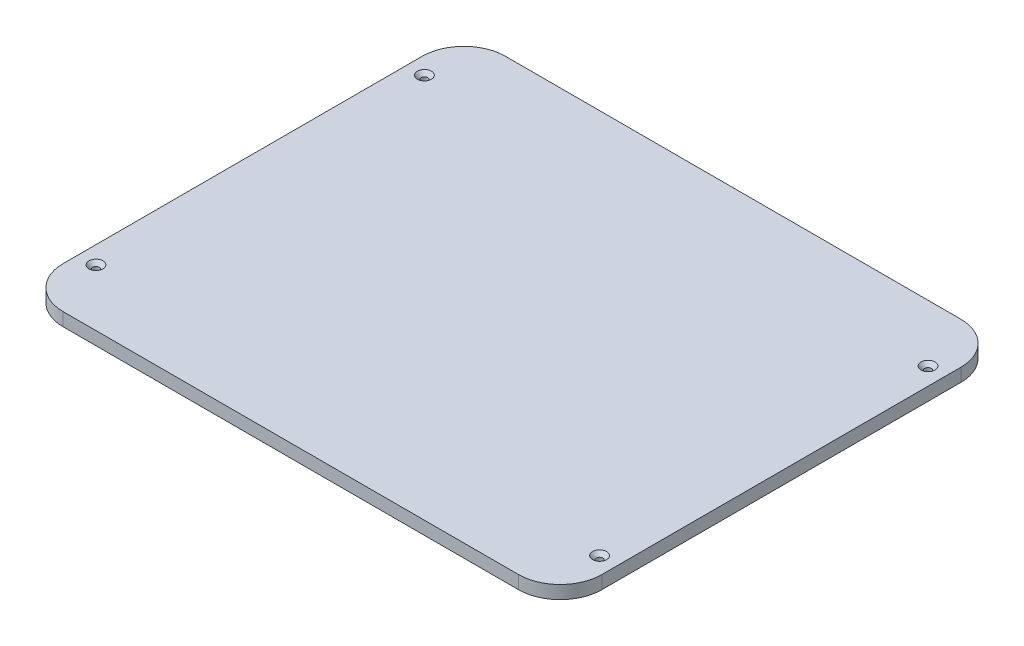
ISO-10303-21;
HEADER;
FILE_DESCRIPTION(('STEP AP214'),'2;1');
FILE_NAME('part.step','',(''),(''),'','','');
FILE_SCHEMA(('AUTOMOTIVE_DESIGN { 1 0 10303 214 1 1 1 1 }'));
ENDSEC;
DATA;
#1=APPLICATION_CONTEXT('core data for automotive mechanical design processes');
#2=APPLICATION_PROTOCOL_DEFINITION('international standard','automotive_design',2000,#1);
#3=PRODUCT_CONTEXT('',#1,'mechanical');
#4=PRODUCT('Part','Part','',(#3));
#5=PRODUCT_RELATED_PRODUCT_CATEGORY('part','',(#4));
#6=PRODUCT_DEFINITION_FORMATION('','',#4);
#7=PRODUCT_DEFINITION_CONTEXT('part definition',#1,'design');
#8=PRODUCT_DEFINITION('design','',#6,#7);
#9=PRODUCT_DEFINITION_SHAPE('','',#8);
#10=(LENGTH_UNIT() NAMED_UNIT(*) SI_UNIT(.MILLI.,.METRE.));
#11=(NAMED_UNIT(*) PLANE_ANGLE_UNIT() SI_UNIT($,.RADIAN.));
#12=(NAMED_UNIT(*) SI_UNIT($,.STERADIAN.) SOLID_ANGLE_UNIT());
#13=UNCERTAINTY_MEASURE_WITH_UNIT(LENGTH_MEASURE(1.E-05),#10,'distance_accuracy_value','');
#14=(GEOMETRIC_REPRESENTATION_CONTEXT(3) GLOBAL_UNCERTAINTY_ASSIGNED_CONTEXT((#13)) GLOBAL_UNIT_ASSIGNED_CONTEXT((#10,
#11,#12)) REPRESENTATION_CONTEXT('',''));
#15=CARTESIAN_POINT('',(0.,0.,0.));
#16=DIRECTION('',(0.,0.,1.));
#17=DIRECTION('',(1.,0.,0.));
#18=AXIS2_PLACEMENT_3D('',#15,#16,#17);
#19=CARTESIAN_POINT('',(123.,6.,101.));
#20=DIRECTION('',(-1.,0.,0.));
#21=DIRECTION('',(0.,0.,1.));
#22=AXIS2_PLACEMENT_3D('',#19,#20,#21);
#23=PLANE('',#22);
#24=DIRECTION('',(0.,0.,-1.));
#25=VECTOR('',#24,1.);
#26=CARTESIAN_POINT('',(123.,0.,101.));
#27=LINE('',#26,#25);
#28=CARTESIAN_POINT('',(123.,0.,82.));
#29=VERTEX_POINT('',#28);
#30=CARTESIAN_POINT('',(123.,0.,-82.));
#31=VERTEX_POINT('',#30);
#32=EDGE_CURVE('E143',#29,#31,#27,.T.);
#33=ORIENTED_EDGE('',*,*,#32,.T.);
#34=DIRECTION('',(0.,-1.,0.));
#35=VECTOR('',#34,1.);
#36=CARTESIAN_POINT('',(123.,6.,-82.));
#37=LINE('',#36,#35);
#38=CARTESIAN_POINT('',(123.,6.,-82.));
#39=VERTEX_POINT('',#38);
#40=EDGE_CURVE('E176',#31,#39,#37,.F.);
#41=ORIENTED_EDGE('',*,*,#40,.T.);
#42=DIRECTION('',(0.,0.,-1.));
#43=VECTOR('',#42,1.);
#44=CARTESIAN_POINT('',(123.,6.,101.));
#45=LINE('',#44,#43);
#46=CARTESIAN_POINT('',(123.,6.,82.));
#47=VERTEX_POINT('',#46);
#48=EDGE_CURVE('E140',#47,#39,#45,.T.);
#49=ORIENTED_EDGE('',*,*,#48,.F.);
#50=DIRECTION('',(0.,-1.,0.));
#51=VECTOR('',#50,1.);
#52=CARTESIAN_POINT('',(123.,6.,82.));
#53=LINE('',#52,#51);
#54=EDGE_CURVE('E172',#47,#29,#53,.T.);
#55=ORIENTED_EDGE('',*,*,#54,.T.);
#56=EDGE_LOOP('',(#33,#41,#49,#55));
#57=FACE_BOUND('',#56,.T.);
#58=ADVANCED_FACE('F38',(#57),#23,.F.);
#59=CARTESIAN_POINT('',(-123.,6.,-101.));
#60=DIRECTION('',(0.,0.,1.));
#61=DIRECTION('',(1.,0.,0.));
#62=AXIS2_PLACEMENT_3D('',#59,#60,#61);
#63=PLANE('',#62);
#64=DIRECTION('',(-1.,0.,0.));
#65=VECTOR('',#64,1.);
#66=CARTESIAN_POINT('',(-123.,0.,-101.));
#67=LINE('',#66,#65);
#68=CARTESIAN_POINT('',(104.,0.,-101.));
#69=VERTEX_POINT('',#68);
#70=CARTESIAN_POINT('',(-104.,0.,-101.));
#71=VERTEX_POINT('',#70);
#72=EDGE_CURVE('E135',#69,#71,#67,.T.);
#73=ORIENTED_EDGE('',*,*,#72,.T.);
#74=DIRECTION('',(0.,-1.,0.));
#75=VECTOR('',#74,1.);
#76=CARTESIAN_POINT('',(-104.,6.,-101.));
#77=LINE('',#76,#75);
#78=CARTESIAN_POINT('',(-104.,6.,-101.));
#79=VERTEX_POINT('',#78);
#80=EDGE_CURVE('E111',#71,#79,#77,.F.);
#81=ORIENTED_EDGE('',*,*,#80,.T.);
#82=DIRECTION('',(-1.,0.,0.));
#83=VECTOR('',#82,1.);
#84=CARTESIAN_POINT('',(-123.,6.,-101.));
#85=LINE('',#84,#83);
#86=CARTESIAN_POINT('',(104.,6.,-101.));
#87=VERTEX_POINT('',#86);
#88=EDGE_CURVE('E292',#87,#79,#85,.T.);
#89=ORIENTED_EDGE('',*,*,#88,.F.);
#90=DIRECTION('',(0.,-1.,0.));
#91=VECTOR('',#90,1.);
#92=CARTESIAN_POINT('',(104.,6.,-101.));
#93=LINE('',#92,#91);
#94=EDGE_CURVE('E117',#87,#69,#93,.T.);
#95=ORIENTED_EDGE('',*,*,#94,.T.);
#96=EDGE_LOOP('',(#73,#81,#89,#95));
#97=FACE_BOUND('',#96,.T.);
#98=ADVANCED_FACE('F228',(#97),#63,.F.);
#99=CARTESIAN_POINT('',(-123.,6.,101.));
#100=DIRECTION('',(1.,0.,0.));
#101=DIRECTION('',(0.,0.,-1.));
#102=AXIS2_PLACEMENT_3D('',#99,#100,#101);
#103=PLANE('',#102);
#104=DIRECTION('',(0.,0.,1.));
#105=VECTOR('',#104,1.);
#106=CARTESIAN_POINT('',(-123.,6.,101.));
#107=LINE('',#106,#105);
#108=CARTESIAN_POINT('',(-123.,6.,-82.));
#109=VERTEX_POINT('',#108);
#110=CARTESIAN_POINT('',(-123.,6.,82.));
#111=VERTEX_POINT('',#110);
#112=EDGE_CURVE('E126',#109,#111,#107,.T.);
#113=ORIENTED_EDGE('',*,*,#112,.F.);
#114=DIRECTION('',(0.,-1.,0.));
#115=VECTOR('',#114,1.);
#116=CARTESIAN_POINT('',(-123.,6.,-82.));
#117=LINE('',#116,#115);
#118=CARTESIAN_POINT('',(-123.,0.,-82.));
#119=VERTEX_POINT('',#118);
#120=EDGE_CURVE('E110',#109,#119,#117,.T.);
#121=ORIENTED_EDGE('',*,*,#120,.T.);
#122=DIRECTION('',(0.,0.,1.));
#123=VECTOR('',#122,1.);
#124=CARTESIAN_POINT('',(-123.,0.,101.));
#125=LINE('',#124,#123);
#126=CARTESIAN_POINT('',(-123.,0.,82.));
#127=VERTEX_POINT('',#126);
#128=EDGE_CURVE('E124',#119,#127,#125,.T.);
#129=ORIENTED_EDGE('',*,*,#128,.T.);
#130=DIRECTION('',(0.,-1.,0.));
#131=VECTOR('',#130,1.);
#132=CARTESIAN_POINT('',(-123.,6.,82.));
#133=LINE('',#132,#131);
#134=EDGE_CURVE('E129',#127,#111,#133,.F.);
#135=ORIENTED_EDGE('',*,*,#134,.T.);
#136=EDGE_LOOP('',(#113,#121,#129,#135));
#137=FACE_BOUND('',#136,.T.);
#138=ADVANCED_FACE('F123',(#137),#103,.F.);
#139=CARTESIAN_POINT('',(-123.,6.,101.));
#140=DIRECTION('',(0.,0.,-1.));
#141=DIRECTION('',(-1.,0.,0.));
#142=AXIS2_PLACEMENT_3D('',#139,#140,#141);
#143=PLANE('',#142);
#144=DIRECTION('',(1.,0.,0.));
#145=VECTOR('',#144,1.);
#146=CARTESIAN_POINT('',(-123.,0.,101.));
#147=LINE('',#146,#145);
#148=CARTESIAN_POINT('',(-104.,0.,101.));
#149=VERTEX_POINT('',#148);
#150=CARTESIAN_POINT('',(104.,0.,101.));
#151=VERTEX_POINT('',#150);
#152=EDGE_CURVE('E134',#149,#151,#147,.T.);
#153=ORIENTED_EDGE('',*,*,#152,.T.);
#154=DIRECTION('',(0.,-1.,0.));
#155=VECTOR('',#154,1.);
#156=CARTESIAN_POINT('',(104.,6.,101.));
#157=LINE('',#156,#155);
#158=CARTESIAN_POINT('',(104.,6.,101.));
#159=VERTEX_POINT('',#158);
#160=EDGE_CURVE('E54',#151,#159,#157,.F.);
#161=ORIENTED_EDGE('',*,*,#160,.T.);
#162=DIRECTION('',(1.,0.,0.));
#163=VECTOR('',#162,1.);
#164=CARTESIAN_POINT('',(-123.,6.,101.));
#165=LINE('',#164,#163);
#166=CARTESIAN_POINT('',(-104.,6.,101.));
#167=VERTEX_POINT('',#166);
#168=EDGE_CURVE('E148',#167,#159,#165,.T.);
#169=ORIENTED_EDGE('',*,*,#168,.F.);
#170=DIRECTION('',(0.,-1.,0.));
#171=VECTOR('',#170,1.);
#172=CARTESIAN_POINT('',(-104.,6.,101.));
#173=LINE('',#172,#171);
#174=EDGE_CURVE('E179',#167,#149,#173,.T.);
#175=ORIENTED_EDGE('',*,*,#174,.T.);
#176=EDGE_LOOP('',(#153,#161,#169,#175));
#177=FACE_BOUND('',#176,.T.);
#178=ADVANCED_FACE('F308',(#177),#143,.F.);
#179=CARTESIAN_POINT('',(0.,6.,0.));
#180=DIRECTION('',(0.,-1.,0.));
#181=DIRECTION('',(0.,0.,-1.));
#182=AXIS2_PLACEMENT_3D('',#179,#180,#181);
#183=PLANE('',#182);
#184=CARTESIAN_POINT('',(-115.,6.,75.));
#185=DIRECTION('',(0.,-1.,0.));
#186=DIRECTION('',(0.,0.,-1.));
#187=AXIS2_PLACEMENT_3D('',#184,#185,#186);
#188=CIRCLE('',#187,3.19999999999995);
#189=CARTESIAN_POINT('',(-115.,6.,71.8));
#190=VERTEX_POINT('',#189);
#191=EDGE_CURVE('E201',#190,#190,#188,.T.);
#192=ORIENTED_EDGE('',*,*,#191,.T.);
#193=EDGE_LOOP('',(#192));
#194=FACE_BOUND('',#193,.T.);
#195=CARTESIAN_POINT('',(115.,6.,75.));
#196=DIRECTION('',(0.,-1.,0.));
#197=DIRECTION('',(0.,0.,-1.));
#198=AXIS2_PLACEMENT_3D('',#195,#196,#197);
#199=CIRCLE('',#198,3.19999999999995);
#200=CARTESIAN_POINT('',(115.,6.,71.8));
#201=VERTEX_POINT('',#200);
#202=EDGE_CURVE('E197',#201,#201,#199,.T.);
#203=ORIENTED_EDGE('',*,*,#202,.T.);
#204=EDGE_LOOP('',(#203));
#205=FACE_BOUND('',#204,.T.);
#206=CARTESIAN_POINT('',(115.,6.,-75.));
#207=DIRECTION('',(0.,-1.,0.));
#208=DIRECTION('',(0.,0.,-1.));
#209=AXIS2_PLACEMENT_3D('',#206,#207,#208);
#210=CIRCLE('',#209,3.19999999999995);
#211=CARTESIAN_POINT('',(115.,6.,-78.1999999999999));
#212=VERTEX_POINT('',#211);
#213=EDGE_CURVE('E193',#212,#212,#210,.T.);
#214=ORIENTED_EDGE('',*,*,#213,.T.);
#215=EDGE_LOOP('',(#214));
#216=FACE_BOUND('',#215,.T.);
#217=CARTESIAN_POINT('',(-115.,6.,-75.));
#218=DIRECTION('',(0.,-1.,0.));
#219=DIRECTION('',(0.,0.,-1.));
#220=AXIS2_PLACEMENT_3D('',#217,#218,#219);
#221=CIRCLE('',#220,3.19999999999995);
#222=CARTESIAN_POINT('',(-115.,6.,-78.1999999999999));
#223=VERTEX_POINT('',#222);
#224=EDGE_CURVE('E189',#223,#223,#221,.T.);
#225=ORIENTED_EDGE('',*,*,#224,.T.);
#226=EDGE_LOOP('',(#225));
#227=FACE_BOUND('',#226,.T.);
#228=ORIENTED_EDGE('',*,*,#88,.T.);
#229=CARTESIAN_POINT('',(-104.,6.,-82.));
#230=DIRECTION('',(0.,-1.,0.));
#231=DIRECTION('',(0.,0.,-1.));
#232=AXIS2_PLACEMENT_3D('',#229,#230,#231);
#233=CIRCLE('',#232,19.);
#234=EDGE_CURVE('E169',#79,#109,#233,.F.);
#235=ORIENTED_EDGE('',*,*,#234,.T.);
#236=ORIENTED_EDGE('',*,*,#112,.T.);
#237=CARTESIAN_POINT('',(-104.,6.,82.));
#238=DIRECTION('',(0.,-1.,0.));
#239=DIRECTION('',(0.,0.,-1.));
#240=AXIS2_PLACEMENT_3D('',#237,#238,#239);
#241=CIRCLE('',#240,19.);
#242=EDGE_CURVE('E61',#111,#167,#241,.F.);
#243=ORIENTED_EDGE('',*,*,#242,.T.);
#244=ORIENTED_EDGE('',*,*,#168,.T.);
#245=CARTESIAN_POINT('',(104.,6.,82.));
#246=DIRECTION('',(0.,-1.,0.));
#247=DIRECTION('',(0.,0.,-1.));
#248=AXIS2_PLACEMENT_3D('',#245,#246,#247);
#249=CIRCLE('',#248,19.);
#250=EDGE_CURVE('E163',#159,#47,#249,.F.);
#251=ORIENTED_EDGE('',*,*,#250,.T.);
#252=ORIENTED_EDGE('',*,*,#48,.T.);
#253=CARTESIAN_POINT('',(104.,6.,-82.));
#254=DIRECTION('',(0.,-1.,0.));
#255=DIRECTION('',(0.,0.,-1.));
#256=AXIS2_PLACEMENT_3D('',#253,#254,#255);
#257=CIRCLE('',#256,19.);
#258=EDGE_CURVE('E166',#39,#87,#257,.F.);
#259=ORIENTED_EDGE('',*,*,#258,.T.);
#260=EDGE_LOOP('',(#228,#235,#236,#243,#244,#251,#252,#259));
#261=FACE_BOUND('',#260,.T.);
#262=ADVANCED_FACE('F306',(#194,#205,#216,#227,#261),#183,.F.);
#263=CARTESIAN_POINT('',(0.,0.,0.));
#264=DIRECTION('',(0.,-1.,0.));
#265=DIRECTION('',(0.,0.,-1.));
#266=AXIS2_PLACEMENT_3D('',#263,#264,#265);
#267=PLANE('',#266);
#268=CARTESIAN_POINT('',(115.,0.,-75.));
#269=DIRECTION('',(0.,1.,0.));
#270=DIRECTION('',(0.,0.,1.));
#271=AXIS2_PLACEMENT_3D('',#268,#269,#270);
#272=CIRCLE('',#271,1.5);
#273=CARTESIAN_POINT('',(115.,0.,-73.5));
#274=VERTEX_POINT('',#273);
#275=EDGE_CURVE('E283',#274,#274,#272,.T.);
#276=ORIENTED_EDGE('',*,*,#275,.T.);
#277=EDGE_LOOP('',(#276));
#278=FACE_BOUND('',#277,.T.);
#279=CARTESIAN_POINT('',(115.,0.,75.));
#280=DIRECTION('',(0.,1.,0.));
#281=DIRECTION('',(0.,0.,1.));
#282=AXIS2_PLACEMENT_3D('',#279,#280,#281);
#283=CIRCLE('',#282,1.5);
#284=CARTESIAN_POINT('',(115.,0.,76.5));
#285=VERTEX_POINT('',#284);
#286=EDGE_CURVE('E275',#285,#285,#283,.T.);
#287=ORIENTED_EDGE('',*,*,#286,.T.);
#288=EDGE_LOOP('',(#287));
#289=FACE_BOUND('',#288,.T.);
#290=CARTESIAN_POINT('',(-115.,0.,75.));
#291=DIRECTION('',(0.,1.,0.));
#292=DIRECTION('',(0.,0.,1.));
#293=AXIS2_PLACEMENT_3D('',#290,#291,#292);
#294=CIRCLE('',#293,1.5);
#295=CARTESIAN_POINT('',(-115.,0.,76.5));
#296=VERTEX_POINT('',#295);
#297=EDGE_CURVE('E271',#296,#296,#294,.T.);
#298=ORIENTED_EDGE('',*,*,#297,.T.);
#299=EDGE_LOOP('',(#298));
#300=FACE_BOUND('',#299,.T.);
#301=CARTESIAN_POINT('',(-115.,0.,-75.));
#302=DIRECTION('',(0.,1.,0.));
#303=DIRECTION('',(0.,0.,1.));
#304=AXIS2_PLACEMENT_3D('',#301,#302,#303);
#305=CIRCLE('',#304,1.5);
#306=CARTESIAN_POINT('',(-115.,0.,-73.5));
#307=VERTEX_POINT('',#306);
#308=EDGE_CURVE('E274',#307,#307,#305,.T.);
#309=ORIENTED_EDGE('',*,*,#308,.T.);
#310=EDGE_LOOP('',(#309));
#311=FACE_BOUND('',#310,.T.);
#312=ORIENTED_EDGE('',*,*,#128,.F.);
#313=CARTESIAN_POINT('',(-104.,0.,-82.));
#314=DIRECTION('',(0.,-1.,0.));
#315=DIRECTION('',(0.,0.,-1.));
#316=AXIS2_PLACEMENT_3D('',#313,#314,#315);
#317=CIRCLE('',#316,19.);
#318=EDGE_CURVE('E106',#119,#71,#317,.T.);
#319=ORIENTED_EDGE('',*,*,#318,.T.);
#320=ORIENTED_EDGE('',*,*,#72,.F.);
#321=CARTESIAN_POINT('',(104.,0.,-82.));
#322=DIRECTION('',(0.,-1.,0.));
#323=DIRECTION('',(0.,0.,-1.));
#324=AXIS2_PLACEMENT_3D('',#321,#322,#323);
#325=CIRCLE('',#324,19.);
#326=EDGE_CURVE('E118',#69,#31,#325,.T.);
#327=ORIENTED_EDGE('',*,*,#326,.T.);
#328=ORIENTED_EDGE('',*,*,#32,.F.);
#329=CARTESIAN_POINT('',(104.,0.,82.));
#330=DIRECTION('',(0.,-1.,0.));
#331=DIRECTION('',(0.,0.,-1.));
#332=AXIS2_PLACEMENT_3D('',#329,#330,#331);
#333=CIRCLE('',#332,19.);
#334=EDGE_CURVE('E152',#29,#151,#333,.T.);
#335=ORIENTED_EDGE('',*,*,#334,.T.);
#336=ORIENTED_EDGE('',*,*,#152,.F.);
#337=CARTESIAN_POINT('',(-104.,0.,82.));
#338=DIRECTION('',(0.,-1.,0.));
#339=DIRECTION('',(0.,0.,-1.));
#340=AXIS2_PLACEMENT_3D('',#337,#338,#339);
#341=CIRCLE('',#340,19.);
#342=EDGE_CURVE('E128',#149,#127,#341,.T.);
#343=ORIENTED_EDGE('',*,*,#342,.T.);
#344=EDGE_LOOP('',(#312,#319,#320,#327,#328,#335,#336,#343));
#345=FACE_BOUND('',#344,.T.);
#346=ADVANCED_FACE('F131',(#278,#289,#300,#311,#345),#267,.T.);
#347=CARTESIAN_POINT('',(-104.,6.,-82.));
#348=DIRECTION('',(0.,-1.,0.));
#349=DIRECTION('',(0.,0.,-1.));
#350=AXIS2_PLACEMENT_3D('',#347,#348,#349);
#351=CYLINDRICAL_SURFACE('',#350,19.);
#352=ORIENTED_EDGE('',*,*,#234,.F.);
#353=ORIENTED_EDGE('',*,*,#80,.F.);
#354=ORIENTED_EDGE('',*,*,#318,.F.);
#355=ORIENTED_EDGE('',*,*,#120,.F.);
#356=EDGE_LOOP('',(#352,#353,#354,#355));
#357=FACE_BOUND('',#356,.T.);
#358=ADVANCED_FACE('F109',(#357),#351,.T.);
#359=CARTESIAN_POINT('',(104.,6.,-82.));
#360=DIRECTION('',(0.,-1.,0.));
#361=DIRECTION('',(0.,0.,-1.));
#362=AXIS2_PLACEMENT_3D('',#359,#360,#361);
#363=CYLINDRICAL_SURFACE('',#362,19.);
#364=ORIENTED_EDGE('',*,*,#258,.F.);
#365=ORIENTED_EDGE('',*,*,#40,.F.);
#366=ORIENTED_EDGE('',*,*,#326,.F.);
#367=ORIENTED_EDGE('',*,*,#94,.F.);
#368=EDGE_LOOP('',(#364,#365,#366,#367));
#369=FACE_BOUND('',#368,.T.);
#370=ADVANCED_FACE('F241',(#369),#363,.T.);
#371=CARTESIAN_POINT('',(104.,6.,82.));
#372=DIRECTION('',(0.,-1.,0.));
#373=DIRECTION('',(0.,0.,-1.));
#374=AXIS2_PLACEMENT_3D('',#371,#372,#373);
#375=CYLINDRICAL_SURFACE('',#374,19.);
#376=ORIENTED_EDGE('',*,*,#250,.F.);
#377=ORIENTED_EDGE('',*,*,#160,.F.);
#378=ORIENTED_EDGE('',*,*,#334,.F.);
#379=ORIENTED_EDGE('',*,*,#54,.F.);
#380=EDGE_LOOP('',(#376,#377,#378,#379));
#381=FACE_BOUND('',#380,.T.);
#382=ADVANCED_FACE('F244',(#381),#375,.T.);
#383=CARTESIAN_POINT('',(-104.,6.,82.));
#384=DIRECTION('',(0.,-1.,0.));
#385=DIRECTION('',(0.,0.,-1.));
#386=AXIS2_PLACEMENT_3D('',#383,#384,#385);
#387=CYLINDRICAL_SURFACE('',#386,19.);
#388=ORIENTED_EDGE('',*,*,#242,.F.);
#389=ORIENTED_EDGE('',*,*,#134,.F.);
#390=ORIENTED_EDGE('',*,*,#342,.F.);
#391=ORIENTED_EDGE('',*,*,#174,.F.);
#392=EDGE_LOOP('',(#388,#389,#390,#391));
#393=FACE_BOUND('',#392,.T.);
#394=ADVANCED_FACE('F248',(#393),#387,.T.);
#395=CARTESIAN_POINT('',(-115.,0.,-75.));
#396=DIRECTION('',(0.,1.,0.));
#397=DIRECTION('',(0.,0.,1.));
#398=AXIS2_PLACEMENT_3D('',#395,#396,#397);
#399=CYLINDRICAL_SURFACE('',#398,1.5);
#400=CARTESIAN_POINT('',(-115.,4.30000000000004,-75.));
#401=DIRECTION('',(0.,-1.,0.));
#402=DIRECTION('',(0.,0.,-1.));
#403=AXIS2_PLACEMENT_3D('',#400,#401,#402);
#404=CIRCLE('',#403,1.5);
#405=CARTESIAN_POINT('',(-115.,4.30000000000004,-76.5));
#406=VERTEX_POINT('',#405);
#407=EDGE_CURVE('E11',#406,#406,#404,.F.);
#408=ORIENTED_EDGE('',*,*,#407,.T.);
#409=EDGE_LOOP('',(#408));
#410=FACE_BOUND('',#409,.T.);
#411=ORIENTED_EDGE('',*,*,#308,.F.);
#412=EDGE_LOOP('',(#411));
#413=FACE_BOUND('',#412,.T.);
#414=ADVANCED_FACE('F252',(#410,#413),#399,.F.);
#415=CARTESIAN_POINT('',(-115.,0.,75.));
#416=DIRECTION('',(0.,1.,0.));
#417=DIRECTION('',(0.,0.,1.));
#418=AXIS2_PLACEMENT_3D('',#415,#416,#417);
#419=CYLINDRICAL_SURFACE('',#418,1.5);
#420=CARTESIAN_POINT('',(-115.,4.30000000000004,75.));
#421=DIRECTION('',(0.,-1.,0.));
#422=DIRECTION('',(0.,0.,-1.));
#423=AXIS2_PLACEMENT_3D('',#420,#421,#422);
#424=CIRCLE('',#423,1.5);
#425=CARTESIAN_POINT('',(-115.,4.30000000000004,73.5));
#426=VERTEX_POINT('',#425);
#427=EDGE_CURVE('E185',#426,#426,#424,.F.);
#428=ORIENTED_EDGE('',*,*,#427,.T.);
#429=EDGE_LOOP('',(#428));
#430=FACE_BOUND('',#429,.T.);
#431=ORIENTED_EDGE('',*,*,#297,.F.);
#432=EDGE_LOOP('',(#431));
#433=FACE_BOUND('',#432,.T.);
#434=ADVANCED_FACE('F265',(#430,#433),#419,.F.);
#435=CARTESIAN_POINT('',(115.,0.,75.));
#436=DIRECTION('',(0.,1.,0.));
#437=DIRECTION('',(0.,0.,1.));
#438=AXIS2_PLACEMENT_3D('',#435,#436,#437);
#439=CYLINDRICAL_SURFACE('',#438,1.5);
#440=CARTESIAN_POINT('',(115.,4.30000000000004,75.));
#441=DIRECTION('',(0.,-1.,0.));
#442=DIRECTION('',(0.,0.,-1.));
#443=AXIS2_PLACEMENT_3D('',#440,#441,#442);
#444=CIRCLE('',#443,1.5);
#445=CARTESIAN_POINT('',(115.,4.30000000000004,73.5));
#446=VERTEX_POINT('',#445);
#447=EDGE_CURVE('E205',#446,#446,#444,.F.);
#448=ORIENTED_EDGE('',*,*,#447,.T.);
#449=EDGE_LOOP('',(#448));
#450=FACE_BOUND('',#449,.T.);
#451=ORIENTED_EDGE('',*,*,#286,.F.);
#452=EDGE_LOOP('',(#451));
#453=FACE_BOUND('',#452,.T.);
#454=ADVANCED_FACE('F259',(#450,#453),#439,.F.);
#455=CARTESIAN_POINT('',(115.,0.,-75.));
#456=DIRECTION('',(0.,1.,0.));
#457=DIRECTION('',(0.,0.,1.));
#458=AXIS2_PLACEMENT_3D('',#455,#456,#457);
#459=CYLINDRICAL_SURFACE('',#458,1.5);
#460=CARTESIAN_POINT('',(115.,4.30000000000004,-75.));
#461=DIRECTION('',(0.,-1.,0.));
#462=DIRECTION('',(0.,0.,-1.));
#463=AXIS2_PLACEMENT_3D('',#460,#461,#462);
#464=CIRCLE('',#463,1.5);
#465=CARTESIAN_POINT('',(115.,4.30000000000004,-76.5));
#466=VERTEX_POINT('',#465);
#467=EDGE_CURVE('E47',#466,#466,#464,.F.);
#468=ORIENTED_EDGE('',*,*,#467,.T.);
#469=EDGE_LOOP('',(#468));
#470=FACE_BOUND('',#469,.T.);
#471=ORIENTED_EDGE('',*,*,#275,.F.);
#472=EDGE_LOOP('',(#471));
#473=FACE_BOUND('',#472,.T.);
#474=ADVANCED_FACE('F211',(#470,#473),#459,.F.);
#475=CARTESIAN_POINT('',(-115.,4.30000000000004,75.));
#476=DIRECTION('',(0.,1.,0.));
#477=DIRECTION('',(0.,0.,1.));
#478=AXIS2_PLACEMENT_3D('',#475,#476,#477);
#479=CONICAL_SURFACE('',#478,1.5,0.785398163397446);
#480=ORIENTED_EDGE('',*,*,#191,.F.);
#481=EDGE_LOOP('',(#480));
#482=FACE_BOUND('',#481,.T.);
#483=ORIENTED_EDGE('',*,*,#427,.F.);
#484=EDGE_LOOP('',(#483));
#485=FACE_BOUND('',#484,.T.);
#486=ADVANCED_FACE('F223',(#482,#485),#479,.F.);
#487=CARTESIAN_POINT('',(115.,4.30000000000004,75.));
#488=DIRECTION('',(0.,1.,0.));
#489=DIRECTION('',(0.,0.,1.));
#490=AXIS2_PLACEMENT_3D('',#487,#488,#489);
#491=CONICAL_SURFACE('',#490,1.5,0.785398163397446);
#492=ORIENTED_EDGE('',*,*,#202,.F.);
#493=EDGE_LOOP('',(#492));
#494=FACE_BOUND('',#493,.T.);
#495=ORIENTED_EDGE('',*,*,#447,.F.);
#496=EDGE_LOOP('',(#495));
#497=FACE_BOUND('',#496,.T.);
#498=ADVANCED_FACE('F216',(#494,#497),#491,.F.);
#499=CARTESIAN_POINT('',(115.,4.30000000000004,-75.));
#500=DIRECTION('',(0.,1.,0.));
#501=DIRECTION('',(0.,0.,1.));
#502=AXIS2_PLACEMENT_3D('',#499,#500,#501);
#503=CONICAL_SURFACE('',#502,1.5,0.785398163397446);
#504=ORIENTED_EDGE('',*,*,#213,.F.);
#505=EDGE_LOOP('',(#504));
#506=FACE_BOUND('',#505,.T.);
#507=ORIENTED_EDGE('',*,*,#467,.F.);
#508=EDGE_LOOP('',(#507));
#509=FACE_BOUND('',#508,.T.);
#510=ADVANCED_FACE('F214',(#506,#509),#503,.F.);
#511=CARTESIAN_POINT('',(-115.,4.30000000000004,-75.));
#512=DIRECTION('',(0.,1.,0.));
#513=DIRECTION('',(0.,0.,1.));
#514=AXIS2_PLACEMENT_3D('',#511,#512,#513);
#515=CONICAL_SURFACE('',#514,1.5,0.785398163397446);
#516=ORIENTED_EDGE('',*,*,#224,.F.);
#517=EDGE_LOOP('',(#516));
#518=FACE_BOUND('',#517,.T.);
#519=ORIENTED_EDGE('',*,*,#407,.F.);
#520=EDGE_LOOP('',(#519));
#521=FACE_BOUND('',#520,.T.);
#522=ADVANCED_FACE('F40',(#518,#521),#515,.F.);
#523=CLOSED_SHELL('',(#58,#98,#138,#178,#262,#346,#358,#370,#382,#394,#414,#434,#454,#474,#486,
#498,#510,#522));
#524=MANIFOLD_SOLID_BREP('B2',#523);
#525=ADVANCED_BREP_SHAPE_REPRESENTATION('',(#18,#524),#14);
#526=SHAPE_DEFINITION_REPRESENTATION(#9,#525);
ENDSEC;
END-ISO-10303-21;
